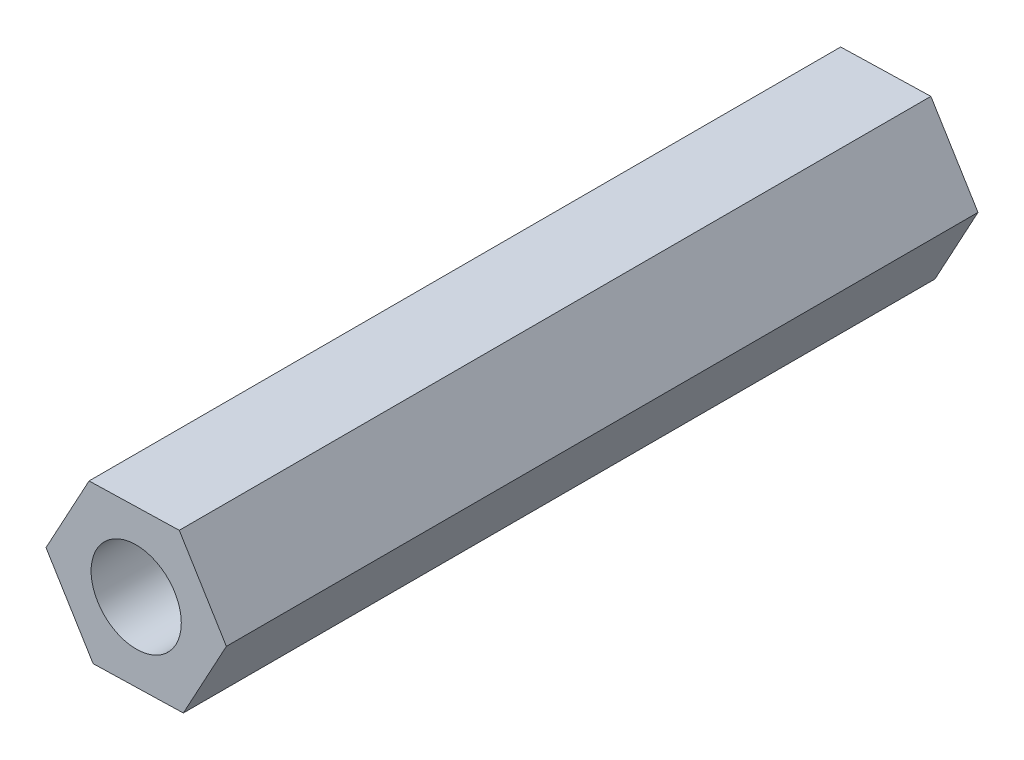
from build123d import *

# Parameters (mm, degrees)
ESQUISSE1_R        = 1.5
BOSS_EXTRU_1_DEPTH = 25


with BuildPart() as part:
    # Esquisse1 → Boss.-Extru.1 (new body)
    with BuildSketch(Plane(origin=(0, 0, 0), x_dir=(-1, 0, 0), z_dir=(0, 0, -1))):
        Polygon((1.432454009, -2.637073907), (3, -0.077995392), (1.567545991, 2.559078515), (-1.432454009, 2.637073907), (-3, 0.077995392), (-1.567545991, -2.559078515), align=None)
        with Locations(Location((0, 0, 0), (0, 0, 180))):
            Circle(ESQUISSE1_R, mode=Mode.SUBTRACT)
    extrude(amount=-BOSS_EXTRU_1_DEPTH)


solid = part.part
